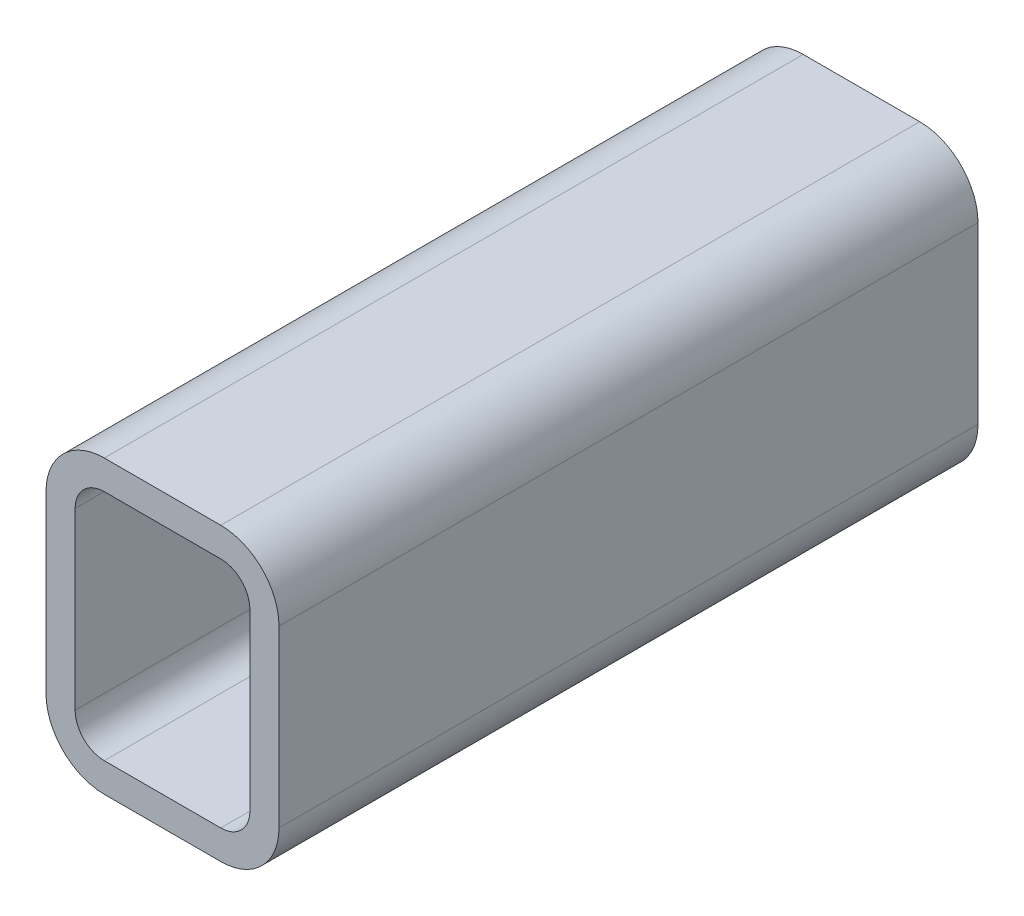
ISO-10303-21;
HEADER;
FILE_DESCRIPTION(('STEP AP214'),'2;1');
FILE_NAME('part.step','',(''),(''),'','','');
FILE_SCHEMA(('AUTOMOTIVE_DESIGN { 1 0 10303 214 1 1 1 1 }'));
ENDSEC;
DATA;
#1=APPLICATION_CONTEXT('core data for automotive mechanical design processes');
#2=APPLICATION_PROTOCOL_DEFINITION('international standard','automotive_design',2000,#1);
#3=PRODUCT_CONTEXT('',#1,'mechanical');
#4=PRODUCT('Part','Part','',(#3));
#5=PRODUCT_RELATED_PRODUCT_CATEGORY('part','',(#4));
#6=PRODUCT_DEFINITION_FORMATION('','',#4);
#7=PRODUCT_DEFINITION_CONTEXT('part definition',#1,'design');
#8=PRODUCT_DEFINITION('design','',#6,#7);
#9=PRODUCT_DEFINITION_SHAPE('','',#8);
#10=(LENGTH_UNIT() NAMED_UNIT(*) SI_UNIT(.MILLI.,.METRE.));
#11=(NAMED_UNIT(*) PLANE_ANGLE_UNIT() SI_UNIT($,.RADIAN.));
#12=(NAMED_UNIT(*) SI_UNIT($,.STERADIAN.) SOLID_ANGLE_UNIT());
#13=UNCERTAINTY_MEASURE_WITH_UNIT(LENGTH_MEASURE(1.E-05),#10,'distance_accuracy_value','');
#14=(GEOMETRIC_REPRESENTATION_CONTEXT(3) GLOBAL_UNCERTAINTY_ASSIGNED_CONTEXT((#13)) GLOBAL_UNIT_ASSIGNED_CONTEXT((#10,
#11,#12)) REPRESENTATION_CONTEXT('',''));
#15=CARTESIAN_POINT('',(0.,0.,0.));
#16=DIRECTION('',(0.,0.,1.));
#17=DIRECTION('',(1.,0.,0.));
#18=AXIS2_PLACEMENT_3D('',#15,#16,#17);
#19=CARTESIAN_POINT('',(27.0751778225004,103.63485662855,304.8));
#20=DIRECTION('',(0.,0.,1.));
#21=DIRECTION('',(1.,0.,0.));
#22=AXIS2_PLACEMENT_3D('',#19,#20,#21);
#23=PLANE('',#22);
#24=CARTESIAN_POINT('',(27.0751778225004,103.63485662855,304.8));
#25=DIRECTION('',(0.,0.,1.));
#26=DIRECTION('',(1.,0.,0.));
#27=AXIS2_PLACEMENT_3D('',#24,#25,#26);
#28=CIRCLE('',#27,25.4);
#29=CARTESIAN_POINT('',(27.0751778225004,129.03485662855,304.8));
#30=VERTEX_POINT('',#29);
#31=CARTESIAN_POINT('',(1.67517782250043,103.63485662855,304.8));
#32=VERTEX_POINT('',#31);
#33=EDGE_CURVE('E211',#30,#32,#28,.T.);
#34=ORIENTED_EDGE('',*,*,#33,.T.);
#35=DIRECTION('',(0.,-1.,0.));
#36=VECTOR('',#35,1.);
#37=CARTESIAN_POINT('',(1.67517782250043,27.4348566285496,304.8));
#38=LINE('',#37,#36);
#39=CARTESIAN_POINT('',(1.67517782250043,27.4348566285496,304.8));
#40=VERTEX_POINT('',#39);
#41=EDGE_CURVE('E214',#32,#40,#38,.T.);
#42=ORIENTED_EDGE('',*,*,#41,.T.);
#43=CARTESIAN_POINT('',(27.0751778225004,27.4348566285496,304.8));
#44=DIRECTION('',(0.,0.,1.));
#45=DIRECTION('',(1.,0.,0.));
#46=AXIS2_PLACEMENT_3D('',#43,#44,#45);
#47=CIRCLE('',#46,25.4);
#48=CARTESIAN_POINT('',(27.0751778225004,2.03485662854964,304.8));
#49=VERTEX_POINT('',#48);
#50=EDGE_CURVE('E217',#40,#49,#47,.T.);
#51=ORIENTED_EDGE('',*,*,#50,.T.);
#52=DIRECTION('',(1.,0.,0.));
#53=VECTOR('',#52,1.);
#54=CARTESIAN_POINT('',(77.8751778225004,2.03485662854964,304.8));
#55=LINE('',#54,#53);
#56=CARTESIAN_POINT('',(77.8751778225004,2.03485662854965,304.8));
#57=VERTEX_POINT('',#56);
#58=EDGE_CURVE('E219',#49,#57,#55,.T.);
#59=ORIENTED_EDGE('',*,*,#58,.T.);
#60=CARTESIAN_POINT('',(77.8751778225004,27.4348566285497,304.8));
#61=DIRECTION('',(0.,0.,1.));
#62=DIRECTION('',(1.,0.,0.));
#63=AXIS2_PLACEMENT_3D('',#60,#61,#62);
#64=CIRCLE('',#63,25.4);
#65=CARTESIAN_POINT('',(103.2751778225,27.4348566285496,304.8));
#66=VERTEX_POINT('',#65);
#67=EDGE_CURVE('E221',#57,#66,#64,.T.);
#68=ORIENTED_EDGE('',*,*,#67,.T.);
#69=DIRECTION('',(0.,1.,0.));
#70=VECTOR('',#69,1.);
#71=CARTESIAN_POINT('',(103.2751778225,103.63485662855,304.8));
#72=LINE('',#71,#70);
#73=CARTESIAN_POINT('',(103.2751778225,103.63485662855,304.8));
#74=VERTEX_POINT('',#73);
#75=EDGE_CURVE('E223',#66,#74,#72,.T.);
#76=ORIENTED_EDGE('',*,*,#75,.T.);
#77=CARTESIAN_POINT('',(77.8751778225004,103.63485662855,304.8));
#78=DIRECTION('',(0.,0.,1.));
#79=DIRECTION('',(1.,0.,0.));
#80=AXIS2_PLACEMENT_3D('',#77,#78,#79);
#81=CIRCLE('',#80,25.4);
#82=CARTESIAN_POINT('',(77.8751778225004,129.03485662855,304.8));
#83=VERTEX_POINT('',#82);
#84=EDGE_CURVE('E225',#74,#83,#81,.T.);
#85=ORIENTED_EDGE('',*,*,#84,.T.);
#86=DIRECTION('',(-1.,0.,0.));
#87=VECTOR('',#86,1.);
#88=CARTESIAN_POINT('',(27.0751778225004,129.03485662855,304.8));
#89=LINE('',#88,#87);
#90=EDGE_CURVE('E227',#83,#30,#89,.T.);
#91=ORIENTED_EDGE('',*,*,#90,.T.);
#92=EDGE_LOOP('',(#34,#42,#51,#59,#68,#76,#85,#91));
#93=FACE_BOUND('',#92,.T.);
#94=DIRECTION('',(0.,-1.,0.));
#95=VECTOR('',#94,1.);
#96=CARTESIAN_POINT('',(14.3751778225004,27.4348566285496,304.8));
#97=LINE('',#96,#95);
#98=CARTESIAN_POINT('',(14.3751778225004,103.63485662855,304.8));
#99=VERTEX_POINT('',#98);
#100=CARTESIAN_POINT('',(14.3751778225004,27.4348566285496,304.8));
#101=VERTEX_POINT('',#100);
#102=EDGE_CURVE('E154',#99,#101,#97,.T.);
#103=ORIENTED_EDGE('',*,*,#102,.F.);
#104=CARTESIAN_POINT('',(27.0751778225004,103.63485662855,304.8));
#105=DIRECTION('',(0.,0.,1.));
#106=DIRECTION('',(1.,0.,0.));
#107=AXIS2_PLACEMENT_3D('',#104,#105,#106);
#108=CIRCLE('',#107,12.7);
#109=CARTESIAN_POINT('',(27.0751778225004,116.33485662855,304.8));
#110=VERTEX_POINT('',#109);
#111=EDGE_CURVE('E146',#110,#99,#108,.T.);
#112=ORIENTED_EDGE('',*,*,#111,.F.);
#113=DIRECTION('',(-1.,0.,0.));
#114=VECTOR('',#113,1.);
#115=CARTESIAN_POINT('',(27.0751778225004,116.33485662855,304.8));
#116=LINE('',#115,#114);
#117=CARTESIAN_POINT('',(77.8751778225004,116.33485662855,304.8));
#118=VERTEX_POINT('',#117);
#119=EDGE_CURVE('E179',#118,#110,#116,.T.);
#120=ORIENTED_EDGE('',*,*,#119,.F.);
#121=CARTESIAN_POINT('',(77.8751778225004,103.63485662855,304.8));
#122=DIRECTION('',(0.,0.,1.));
#123=DIRECTION('',(1.,0.,0.));
#124=AXIS2_PLACEMENT_3D('',#121,#122,#123);
#125=CIRCLE('',#124,12.7);
#126=CARTESIAN_POINT('',(90.5751778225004,103.63485662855,304.8));
#127=VERTEX_POINT('',#126);
#128=EDGE_CURVE('E177',#127,#118,#125,.T.);
#129=ORIENTED_EDGE('',*,*,#128,.F.);
#130=DIRECTION('',(0.,1.,0.));
#131=VECTOR('',#130,1.);
#132=CARTESIAN_POINT('',(90.5751778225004,103.63485662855,304.8));
#133=LINE('',#132,#131);
#134=CARTESIAN_POINT('',(90.5751778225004,27.4348566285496,304.8));
#135=VERTEX_POINT('',#134);
#136=EDGE_CURVE('E175',#135,#127,#133,.T.);
#137=ORIENTED_EDGE('',*,*,#136,.F.);
#138=CARTESIAN_POINT('',(77.8751778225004,27.4348566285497,304.8));
#139=DIRECTION('',(0.,0.,1.));
#140=DIRECTION('',(1.,0.,0.));
#141=AXIS2_PLACEMENT_3D('',#138,#139,#140);
#142=CIRCLE('',#141,12.7);
#143=CARTESIAN_POINT('',(77.8751778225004,14.7348566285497,304.8));
#144=VERTEX_POINT('',#143);
#145=EDGE_CURVE('E173',#144,#135,#142,.T.);
#146=ORIENTED_EDGE('',*,*,#145,.F.);
#147=DIRECTION('',(1.,0.,0.));
#148=VECTOR('',#147,1.);
#149=CARTESIAN_POINT('',(77.8751778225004,14.7348566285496,304.8));
#150=LINE('',#149,#148);
#151=CARTESIAN_POINT('',(27.0751778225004,14.7348566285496,304.8));
#152=VERTEX_POINT('',#151);
#153=EDGE_CURVE('E169',#152,#144,#150,.T.);
#154=ORIENTED_EDGE('',*,*,#153,.F.);
#155=CARTESIAN_POINT('',(27.0751778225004,27.4348566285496,304.8));
#156=DIRECTION('',(0.,0.,1.));
#157=DIRECTION('',(1.,0.,0.));
#158=AXIS2_PLACEMENT_3D('',#155,#156,#157);
#159=CIRCLE('',#158,12.7);
#160=EDGE_CURVE('E167',#101,#152,#159,.T.);
#161=ORIENTED_EDGE('',*,*,#160,.F.);
#162=EDGE_LOOP('',(#103,#112,#120,#129,#137,#146,#154,#161));
#163=FACE_BOUND('',#162,.T.);
#164=ADVANCED_FACE('F33',(#93,#163),#23,.T.);
#165=CARTESIAN_POINT('',(27.0751778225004,103.63485662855,0.));
#166=DIRECTION('',(0.,0.,1.));
#167=DIRECTION('',(1.,0.,0.));
#168=AXIS2_PLACEMENT_3D('',#165,#166,#167);
#169=PLANE('',#168);
#170=CARTESIAN_POINT('',(27.0751778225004,103.63485662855,0.));
#171=DIRECTION('',(0.,0.,1.));
#172=DIRECTION('',(1.,0.,0.));
#173=AXIS2_PLACEMENT_3D('',#170,#171,#172);
#174=CIRCLE('',#173,25.4);
#175=CARTESIAN_POINT('',(27.0751778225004,129.03485662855,0.));
#176=VERTEX_POINT('',#175);
#177=CARTESIAN_POINT('',(1.67517782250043,103.63485662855,0.));
#178=VERTEX_POINT('',#177);
#179=EDGE_CURVE('E162',#176,#178,#174,.T.);
#180=ORIENTED_EDGE('',*,*,#179,.F.);
#181=DIRECTION('',(-1.,0.,0.));
#182=VECTOR('',#181,1.);
#183=CARTESIAN_POINT('',(27.0751778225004,129.03485662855,0.));
#184=LINE('',#183,#182);
#185=CARTESIAN_POINT('',(77.8751778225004,129.03485662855,0.));
#186=VERTEX_POINT('',#185);
#187=EDGE_CURVE('E215',#186,#176,#184,.T.);
#188=ORIENTED_EDGE('',*,*,#187,.F.);
#189=CARTESIAN_POINT('',(77.8751778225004,103.63485662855,0.));
#190=DIRECTION('',(0.,0.,1.));
#191=DIRECTION('',(1.,0.,0.));
#192=AXIS2_PLACEMENT_3D('',#189,#190,#191);
#193=CIRCLE('',#192,25.4);
#194=CARTESIAN_POINT('',(103.2751778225,103.63485662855,0.));
#195=VERTEX_POINT('',#194);
#196=EDGE_CURVE('E242',#195,#186,#193,.T.);
#197=ORIENTED_EDGE('',*,*,#196,.F.);
#198=DIRECTION('',(0.,1.,0.));
#199=VECTOR('',#198,1.);
#200=CARTESIAN_POINT('',(103.2751778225,103.63485662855,0.));
#201=LINE('',#200,#199);
#202=CARTESIAN_POINT('',(103.2751778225,27.4348566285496,0.));
#203=VERTEX_POINT('',#202);
#204=EDGE_CURVE('E240',#203,#195,#201,.T.);
#205=ORIENTED_EDGE('',*,*,#204,.F.);
#206=CARTESIAN_POINT('',(77.8751778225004,27.4348566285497,0.));
#207=DIRECTION('',(0.,0.,1.));
#208=DIRECTION('',(1.,0.,0.));
#209=AXIS2_PLACEMENT_3D('',#206,#207,#208);
#210=CIRCLE('',#209,25.4);
#211=CARTESIAN_POINT('',(77.8751778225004,2.03485662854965,0.));
#212=VERTEX_POINT('',#211);
#213=EDGE_CURVE('E238',#212,#203,#210,.T.);
#214=ORIENTED_EDGE('',*,*,#213,.F.);
#215=DIRECTION('',(1.,0.,0.));
#216=VECTOR('',#215,1.);
#217=CARTESIAN_POINT('',(77.8751778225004,2.03485662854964,0.));
#218=LINE('',#217,#216);
#219=CARTESIAN_POINT('',(27.0751778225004,2.03485662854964,0.));
#220=VERTEX_POINT('',#219);
#221=EDGE_CURVE('E236',#220,#212,#218,.T.);
#222=ORIENTED_EDGE('',*,*,#221,.F.);
#223=CARTESIAN_POINT('',(27.0751778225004,27.4348566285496,0.));
#224=DIRECTION('',(0.,0.,1.));
#225=DIRECTION('',(1.,0.,0.));
#226=AXIS2_PLACEMENT_3D('',#223,#224,#225);
#227=CIRCLE('',#226,25.4);
#228=CARTESIAN_POINT('',(1.67517782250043,27.4348566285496,0.));
#229=VERTEX_POINT('',#228);
#230=EDGE_CURVE('E234',#229,#220,#227,.T.);
#231=ORIENTED_EDGE('',*,*,#230,.F.);
#232=DIRECTION('',(0.,-1.,0.));
#233=VECTOR('',#232,1.);
#234=CARTESIAN_POINT('',(1.67517782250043,27.4348566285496,0.));
#235=LINE('',#234,#233);
#236=EDGE_CURVE('E232',#178,#229,#235,.T.);
#237=ORIENTED_EDGE('',*,*,#236,.F.);
#238=EDGE_LOOP('',(#180,#188,#197,#205,#214,#222,#231,#237));
#239=FACE_BOUND('',#238,.T.);
#240=CARTESIAN_POINT('',(27.0751778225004,103.63485662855,0.));
#241=DIRECTION('',(0.,0.,1.));
#242=DIRECTION('',(1.,0.,0.));
#243=AXIS2_PLACEMENT_3D('',#240,#241,#242);
#244=CIRCLE('',#243,12.7);
#245=CARTESIAN_POINT('',(27.0751778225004,116.33485662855,0.));
#246=VERTEX_POINT('',#245);
#247=CARTESIAN_POINT('',(14.3751778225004,103.63485662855,0.));
#248=VERTEX_POINT('',#247);
#249=EDGE_CURVE('E56',#246,#248,#244,.T.);
#250=ORIENTED_EDGE('',*,*,#249,.T.);
#251=DIRECTION('',(0.,-1.,0.));
#252=VECTOR('',#251,1.);
#253=CARTESIAN_POINT('',(14.3751778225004,27.4348566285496,0.));
#254=LINE('',#253,#252);
#255=CARTESIAN_POINT('',(14.3751778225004,27.4348566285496,0.));
#256=VERTEX_POINT('',#255);
#257=EDGE_CURVE('E161',#248,#256,#254,.T.);
#258=ORIENTED_EDGE('',*,*,#257,.T.);
#259=CARTESIAN_POINT('',(27.0751778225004,27.4348566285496,0.));
#260=DIRECTION('',(0.,0.,1.));
#261=DIRECTION('',(1.,0.,0.));
#262=AXIS2_PLACEMENT_3D('',#259,#260,#261);
#263=CIRCLE('',#262,12.7);
#264=CARTESIAN_POINT('',(27.0751778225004,14.7348566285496,0.));
#265=VERTEX_POINT('',#264);
#266=EDGE_CURVE('E183',#256,#265,#263,.T.);
#267=ORIENTED_EDGE('',*,*,#266,.T.);
#268=DIRECTION('',(1.,0.,0.));
#269=VECTOR('',#268,1.);
#270=CARTESIAN_POINT('',(77.8751778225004,14.7348566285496,0.));
#271=LINE('',#270,#269);
#272=CARTESIAN_POINT('',(77.8751778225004,14.7348566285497,0.));
#273=VERTEX_POINT('',#272);
#274=EDGE_CURVE('E186',#265,#273,#271,.T.);
#275=ORIENTED_EDGE('',*,*,#274,.T.);
#276=CARTESIAN_POINT('',(77.8751778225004,27.4348566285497,0.));
#277=DIRECTION('',(0.,0.,1.));
#278=DIRECTION('',(1.,0.,0.));
#279=AXIS2_PLACEMENT_3D('',#276,#277,#278);
#280=CIRCLE('',#279,12.7);
#281=CARTESIAN_POINT('',(90.5751778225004,27.4348566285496,0.));
#282=VERTEX_POINT('',#281);
#283=EDGE_CURVE('E189',#273,#282,#280,.T.);
#284=ORIENTED_EDGE('',*,*,#283,.T.);
#285=DIRECTION('',(0.,1.,0.));
#286=VECTOR('',#285,1.);
#287=CARTESIAN_POINT('',(90.5751778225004,103.63485662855,0.));
#288=LINE('',#287,#286);
#289=CARTESIAN_POINT('',(90.5751778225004,103.63485662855,0.));
#290=VERTEX_POINT('',#289);
#291=EDGE_CURVE('E192',#282,#290,#288,.T.);
#292=ORIENTED_EDGE('',*,*,#291,.T.);
#293=CARTESIAN_POINT('',(77.8751778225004,103.63485662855,0.));
#294=DIRECTION('',(0.,0.,1.));
#295=DIRECTION('',(1.,0.,0.));
#296=AXIS2_PLACEMENT_3D('',#293,#294,#295);
#297=CIRCLE('',#296,12.7);
#298=CARTESIAN_POINT('',(77.8751778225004,116.33485662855,0.));
#299=VERTEX_POINT('',#298);
#300=EDGE_CURVE('E195',#290,#299,#297,.T.);
#301=ORIENTED_EDGE('',*,*,#300,.T.);
#302=DIRECTION('',(-1.,0.,0.));
#303=VECTOR('',#302,1.);
#304=CARTESIAN_POINT('',(27.0751778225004,116.33485662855,0.));
#305=LINE('',#304,#303);
#306=EDGE_CURVE('E155',#299,#246,#305,.T.);
#307=ORIENTED_EDGE('',*,*,#306,.T.);
#308=EDGE_LOOP('',(#250,#258,#267,#275,#284,#292,#301,#307));
#309=FACE_BOUND('',#308,.T.);
#310=ADVANCED_FACE('F272',(#239,#309),#169,.F.);
#311=CARTESIAN_POINT('',(27.0751778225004,103.63485662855,304.8));
#312=DIRECTION('',(0.,0.,-1.));
#313=DIRECTION('',(-1.,0.,0.));
#314=AXIS2_PLACEMENT_3D('',#311,#312,#313);
#315=CYLINDRICAL_SURFACE('',#314,25.4);
#316=ORIENTED_EDGE('',*,*,#179,.T.);
#317=DIRECTION('',(0.,0.,-1.));
#318=VECTOR('',#317,1.);
#319=CARTESIAN_POINT('',(1.67517782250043,103.63485662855,304.8));
#320=LINE('',#319,#318);
#321=EDGE_CURVE('E11',#32,#178,#320,.T.);
#322=ORIENTED_EDGE('',*,*,#321,.F.);
#323=ORIENTED_EDGE('',*,*,#33,.F.);
#324=DIRECTION('',(0.,0.,-1.));
#325=VECTOR('',#324,1.);
#326=CARTESIAN_POINT('',(27.0751778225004,129.03485662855,304.8));
#327=LINE('',#326,#325);
#328=EDGE_CURVE('E229',#30,#176,#327,.T.);
#329=ORIENTED_EDGE('',*,*,#328,.T.);
#330=EDGE_LOOP('',(#316,#322,#323,#329));
#331=FACE_BOUND('',#330,.T.);
#332=ADVANCED_FACE('F35',(#331),#315,.T.);
#333=CARTESIAN_POINT('',(1.67517782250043,27.4348566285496,304.8));
#334=DIRECTION('',(1.,0.,0.));
#335=DIRECTION('',(0.,0.,-1.));
#336=AXIS2_PLACEMENT_3D('',#333,#334,#335);
#337=PLANE('',#336);
#338=ORIENTED_EDGE('',*,*,#236,.T.);
#339=DIRECTION('',(0.,0.,-1.));
#340=VECTOR('',#339,1.);
#341=CARTESIAN_POINT('',(1.67517782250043,27.4348566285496,304.8));
#342=LINE('',#341,#340);
#343=EDGE_CURVE('E41',#40,#229,#342,.T.);
#344=ORIENTED_EDGE('',*,*,#343,.F.);
#345=ORIENTED_EDGE('',*,*,#41,.F.);
#346=ORIENTED_EDGE('',*,*,#321,.T.);
#347=EDGE_LOOP('',(#338,#344,#345,#346));
#348=FACE_BOUND('',#347,.T.);
#349=ADVANCED_FACE('F289',(#348),#337,.F.);
#350=CARTESIAN_POINT('',(27.0751778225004,27.4348566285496,304.8));
#351=DIRECTION('',(0.,0.,-1.));
#352=DIRECTION('',(-1.,0.,0.));
#353=AXIS2_PLACEMENT_3D('',#350,#351,#352);
#354=CYLINDRICAL_SURFACE('',#353,25.4);
#355=ORIENTED_EDGE('',*,*,#230,.T.);
#356=DIRECTION('',(0.,0.,-1.));
#357=VECTOR('',#356,1.);
#358=CARTESIAN_POINT('',(27.0751778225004,2.03485662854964,304.8));
#359=LINE('',#358,#357);
#360=EDGE_CURVE('E259',#49,#220,#359,.T.);
#361=ORIENTED_EDGE('',*,*,#360,.F.);
#362=ORIENTED_EDGE('',*,*,#50,.F.);
#363=ORIENTED_EDGE('',*,*,#343,.T.);
#364=EDGE_LOOP('',(#355,#361,#362,#363));
#365=FACE_BOUND('',#364,.T.);
#366=ADVANCED_FACE('F266',(#365),#354,.T.);
#367=CARTESIAN_POINT('',(77.8751778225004,2.03485662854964,304.8));
#368=DIRECTION('',(0.,1.,0.));
#369=DIRECTION('',(0.,0.,1.));
#370=AXIS2_PLACEMENT_3D('',#367,#368,#369);
#371=PLANE('',#370);
#372=ORIENTED_EDGE('',*,*,#221,.T.);
#373=DIRECTION('',(0.,0.,-1.));
#374=VECTOR('',#373,1.);
#375=CARTESIAN_POINT('',(77.8751778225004,2.03485662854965,304.8));
#376=LINE('',#375,#374);
#377=EDGE_CURVE('E256',#57,#212,#376,.T.);
#378=ORIENTED_EDGE('',*,*,#377,.F.);
#379=ORIENTED_EDGE('',*,*,#58,.F.);
#380=ORIENTED_EDGE('',*,*,#360,.T.);
#381=EDGE_LOOP('',(#372,#378,#379,#380));
#382=FACE_BOUND('',#381,.T.);
#383=ADVANCED_FACE('F278',(#382),#371,.F.);
#384=CARTESIAN_POINT('',(77.8751778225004,27.4348566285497,304.8));
#385=DIRECTION('',(0.,0.,-1.));
#386=DIRECTION('',(-1.,0.,0.));
#387=AXIS2_PLACEMENT_3D('',#384,#385,#386);
#388=CYLINDRICAL_SURFACE('',#387,25.4);
#389=ORIENTED_EDGE('',*,*,#213,.T.);
#390=DIRECTION('',(0.,0.,-1.));
#391=VECTOR('',#390,1.);
#392=CARTESIAN_POINT('',(103.2751778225,27.4348566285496,304.8));
#393=LINE('',#392,#391);
#394=EDGE_CURVE('E253',#66,#203,#393,.T.);
#395=ORIENTED_EDGE('',*,*,#394,.F.);
#396=ORIENTED_EDGE('',*,*,#67,.F.);
#397=ORIENTED_EDGE('',*,*,#377,.T.);
#398=EDGE_LOOP('',(#389,#395,#396,#397));
#399=FACE_BOUND('',#398,.T.);
#400=ADVANCED_FACE('F282',(#399),#388,.T.);
#401=CARTESIAN_POINT('',(103.2751778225,103.63485662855,304.8));
#402=DIRECTION('',(-1.,0.,0.));
#403=DIRECTION('',(0.,0.,1.));
#404=AXIS2_PLACEMENT_3D('',#401,#402,#403);
#405=PLANE('',#404);
#406=ORIENTED_EDGE('',*,*,#204,.T.);
#407=DIRECTION('',(0.,0.,-1.));
#408=VECTOR('',#407,1.);
#409=CARTESIAN_POINT('',(103.2751778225,103.63485662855,304.8));
#410=LINE('',#409,#408);
#411=EDGE_CURVE('E250',#74,#195,#410,.T.);
#412=ORIENTED_EDGE('',*,*,#411,.F.);
#413=ORIENTED_EDGE('',*,*,#75,.F.);
#414=ORIENTED_EDGE('',*,*,#394,.T.);
#415=EDGE_LOOP('',(#406,#412,#413,#414));
#416=FACE_BOUND('',#415,.T.);
#417=ADVANCED_FACE('F302',(#416),#405,.F.);
#418=CARTESIAN_POINT('',(77.8751778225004,103.63485662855,304.8));
#419=DIRECTION('',(0.,0.,-1.));
#420=DIRECTION('',(-1.,0.,0.));
#421=AXIS2_PLACEMENT_3D('',#418,#419,#420);
#422=CYLINDRICAL_SURFACE('',#421,25.4);
#423=ORIENTED_EDGE('',*,*,#196,.T.);
#424=DIRECTION('',(0.,0.,-1.));
#425=VECTOR('',#424,1.);
#426=CARTESIAN_POINT('',(77.8751778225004,129.03485662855,304.8));
#427=LINE('',#426,#425);
#428=EDGE_CURVE('E247',#83,#186,#427,.T.);
#429=ORIENTED_EDGE('',*,*,#428,.F.);
#430=ORIENTED_EDGE('',*,*,#84,.F.);
#431=ORIENTED_EDGE('',*,*,#411,.T.);
#432=EDGE_LOOP('',(#423,#429,#430,#431));
#433=FACE_BOUND('',#432,.T.);
#434=ADVANCED_FACE('F300',(#433),#422,.T.);
#435=CARTESIAN_POINT('',(27.0751778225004,129.03485662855,304.8));
#436=DIRECTION('',(0.,-1.,0.));
#437=DIRECTION('',(0.,0.,-1.));
#438=AXIS2_PLACEMENT_3D('',#435,#436,#437);
#439=PLANE('',#438);
#440=ORIENTED_EDGE('',*,*,#187,.T.);
#441=ORIENTED_EDGE('',*,*,#328,.F.);
#442=ORIENTED_EDGE('',*,*,#90,.F.);
#443=ORIENTED_EDGE('',*,*,#428,.T.);
#444=EDGE_LOOP('',(#440,#441,#442,#443));
#445=FACE_BOUND('',#444,.T.);
#446=ADVANCED_FACE('F295',(#445),#439,.F.);
#447=CARTESIAN_POINT('',(27.0751778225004,103.63485662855,304.8));
#448=DIRECTION('',(0.,0.,-1.));
#449=DIRECTION('',(-1.,0.,0.));
#450=AXIS2_PLACEMENT_3D('',#447,#448,#449);
#451=CYLINDRICAL_SURFACE('',#450,12.7);
#452=ORIENTED_EDGE('',*,*,#249,.F.);
#453=DIRECTION('',(0.,0.,-1.));
#454=VECTOR('',#453,1.);
#455=CARTESIAN_POINT('',(27.0751778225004,116.33485662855,304.8));
#456=LINE('',#455,#454);
#457=EDGE_CURVE('E150',#110,#246,#456,.T.);
#458=ORIENTED_EDGE('',*,*,#457,.F.);
#459=ORIENTED_EDGE('',*,*,#111,.T.);
#460=DIRECTION('',(0.,0.,-1.));
#461=VECTOR('',#460,1.);
#462=CARTESIAN_POINT('',(14.3751778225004,103.63485662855,304.8));
#463=LINE('',#462,#461);
#464=EDGE_CURVE('E149',#99,#248,#463,.T.);
#465=ORIENTED_EDGE('',*,*,#464,.T.);
#466=EDGE_LOOP('',(#452,#458,#459,#465));
#467=FACE_BOUND('',#466,.T.);
#468=ADVANCED_FACE('F148',(#467),#451,.F.);
#469=CARTESIAN_POINT('',(14.3751778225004,27.4348566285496,304.8));
#470=DIRECTION('',(1.,0.,0.));
#471=DIRECTION('',(0.,0.,-1.));
#472=AXIS2_PLACEMENT_3D('',#469,#470,#471);
#473=PLANE('',#472);
#474=ORIENTED_EDGE('',*,*,#257,.F.);
#475=ORIENTED_EDGE('',*,*,#464,.F.);
#476=ORIENTED_EDGE('',*,*,#102,.T.);
#477=DIRECTION('',(0.,0.,-1.));
#478=VECTOR('',#477,1.);
#479=CARTESIAN_POINT('',(14.3751778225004,27.4348566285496,304.8));
#480=LINE('',#479,#478);
#481=EDGE_CURVE('E163',#101,#256,#480,.T.);
#482=ORIENTED_EDGE('',*,*,#481,.T.);
#483=EDGE_LOOP('',(#474,#475,#476,#482));
#484=FACE_BOUND('',#483,.T.);
#485=ADVANCED_FACE('F158',(#484),#473,.T.);
#486=CARTESIAN_POINT('',(27.0751778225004,27.4348566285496,304.8));
#487=DIRECTION('',(0.,0.,-1.));
#488=DIRECTION('',(-1.,0.,0.));
#489=AXIS2_PLACEMENT_3D('',#486,#487,#488);
#490=CYLINDRICAL_SURFACE('',#489,12.7);
#491=ORIENTED_EDGE('',*,*,#266,.F.);
#492=ORIENTED_EDGE('',*,*,#481,.F.);
#493=ORIENTED_EDGE('',*,*,#160,.T.);
#494=DIRECTION('',(0.,0.,-1.));
#495=VECTOR('',#494,1.);
#496=CARTESIAN_POINT('',(27.0751778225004,14.7348566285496,304.8));
#497=LINE('',#496,#495);
#498=EDGE_CURVE('E208',#152,#265,#497,.T.);
#499=ORIENTED_EDGE('',*,*,#498,.T.);
#500=EDGE_LOOP('',(#491,#492,#493,#499));
#501=FACE_BOUND('',#500,.T.);
#502=ADVANCED_FACE('F327',(#501),#490,.F.);
#503=CARTESIAN_POINT('',(77.8751778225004,14.7348566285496,304.8));
#504=DIRECTION('',(0.,1.,0.));
#505=DIRECTION('',(0.,0.,1.));
#506=AXIS2_PLACEMENT_3D('',#503,#504,#505);
#507=PLANE('',#506);
#508=ORIENTED_EDGE('',*,*,#274,.F.);
#509=ORIENTED_EDGE('',*,*,#498,.F.);
#510=ORIENTED_EDGE('',*,*,#153,.T.);
#511=DIRECTION('',(0.,0.,-1.));
#512=VECTOR('',#511,1.);
#513=CARTESIAN_POINT('',(77.8751778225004,14.7348566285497,304.8));
#514=LINE('',#513,#512);
#515=EDGE_CURVE('E206',#144,#273,#514,.T.);
#516=ORIENTED_EDGE('',*,*,#515,.T.);
#517=EDGE_LOOP('',(#508,#509,#510,#516));
#518=FACE_BOUND('',#517,.T.);
#519=ADVANCED_FACE('F331',(#518),#507,.T.);
#520=CARTESIAN_POINT('',(77.8751778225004,27.4348566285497,304.8));
#521=DIRECTION('',(0.,0.,-1.));
#522=DIRECTION('',(-1.,0.,0.));
#523=AXIS2_PLACEMENT_3D('',#520,#521,#522);
#524=CYLINDRICAL_SURFACE('',#523,12.7);
#525=ORIENTED_EDGE('',*,*,#283,.F.);
#526=ORIENTED_EDGE('',*,*,#515,.F.);
#527=ORIENTED_EDGE('',*,*,#145,.T.);
#528=DIRECTION('',(0.,0.,-1.));
#529=VECTOR('',#528,1.);
#530=CARTESIAN_POINT('',(90.5751778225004,27.4348566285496,304.8));
#531=LINE('',#530,#529);
#532=EDGE_CURVE('E204',#135,#282,#531,.T.);
#533=ORIENTED_EDGE('',*,*,#532,.T.);
#534=EDGE_LOOP('',(#525,#526,#527,#533));
#535=FACE_BOUND('',#534,.T.);
#536=ADVANCED_FACE('F337',(#535),#524,.F.);
#537=CARTESIAN_POINT('',(90.5751778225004,103.63485662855,304.8));
#538=DIRECTION('',(-1.,0.,0.));
#539=DIRECTION('',(0.,0.,1.));
#540=AXIS2_PLACEMENT_3D('',#537,#538,#539);
#541=PLANE('',#540);
#542=ORIENTED_EDGE('',*,*,#291,.F.);
#543=ORIENTED_EDGE('',*,*,#532,.F.);
#544=ORIENTED_EDGE('',*,*,#136,.T.);
#545=DIRECTION('',(0.,0.,-1.));
#546=VECTOR('',#545,1.);
#547=CARTESIAN_POINT('',(90.5751778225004,103.63485662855,304.8));
#548=LINE('',#547,#546);
#549=EDGE_CURVE('E202',#127,#290,#548,.T.);
#550=ORIENTED_EDGE('',*,*,#549,.T.);
#551=EDGE_LOOP('',(#542,#543,#544,#550));
#552=FACE_BOUND('',#551,.T.);
#553=ADVANCED_FACE('F341',(#552),#541,.T.);
#554=CARTESIAN_POINT('',(77.8751778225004,103.63485662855,304.8));
#555=DIRECTION('',(0.,0.,-1.));
#556=DIRECTION('',(-1.,0.,0.));
#557=AXIS2_PLACEMENT_3D('',#554,#555,#556);
#558=CYLINDRICAL_SURFACE('',#557,12.7);
#559=ORIENTED_EDGE('',*,*,#300,.F.);
#560=ORIENTED_EDGE('',*,*,#549,.F.);
#561=ORIENTED_EDGE('',*,*,#128,.T.);
#562=DIRECTION('',(0.,0.,-1.));
#563=VECTOR('',#562,1.);
#564=CARTESIAN_POINT('',(77.8751778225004,116.33485662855,304.8));
#565=LINE('',#564,#563);
#566=EDGE_CURVE('E48',#118,#299,#565,.T.);
#567=ORIENTED_EDGE('',*,*,#566,.T.);
#568=EDGE_LOOP('',(#559,#560,#561,#567));
#569=FACE_BOUND('',#568,.T.);
#570=ADVANCED_FACE('F345',(#569),#558,.F.);
#571=CARTESIAN_POINT('',(27.0751778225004,116.33485662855,304.8));
#572=DIRECTION('',(0.,-1.,0.));
#573=DIRECTION('',(0.,0.,-1.));
#574=AXIS2_PLACEMENT_3D('',#571,#572,#573);
#575=PLANE('',#574);
#576=ORIENTED_EDGE('',*,*,#306,.F.);
#577=ORIENTED_EDGE('',*,*,#566,.F.);
#578=ORIENTED_EDGE('',*,*,#119,.T.);
#579=ORIENTED_EDGE('',*,*,#457,.T.);
#580=EDGE_LOOP('',(#576,#577,#578,#579));
#581=FACE_BOUND('',#580,.T.);
#582=ADVANCED_FACE('F349',(#581),#575,.T.);
#583=CLOSED_SHELL('',(#164,#310,#332,#349,#366,#383,#400,#417,#434,#446,#468,#485,#502,#519,
#536,#553,#570,#582));
#584=MANIFOLD_SOLID_BREP('B2',#583);
#585=ADVANCED_BREP_SHAPE_REPRESENTATION('',(#18,#584),#14);
#586=SHAPE_DEFINITION_REPRESENTATION(#9,#585);
ENDSEC;
END-ISO-10303-21;
